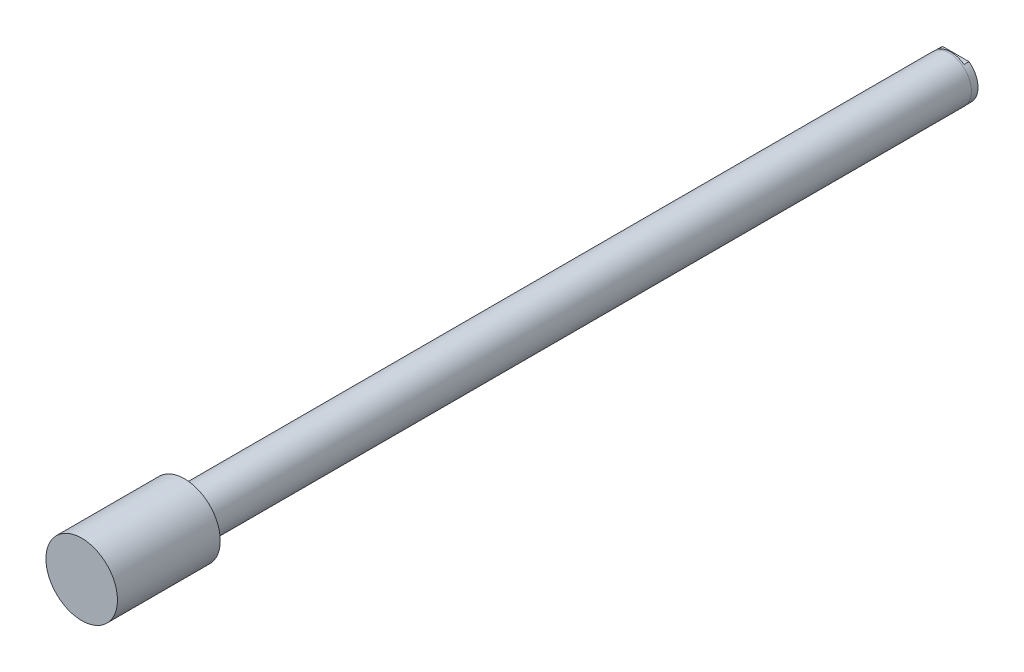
ISO-10303-21;
HEADER;
FILE_DESCRIPTION(('STEP AP214'),'2;1');
FILE_NAME('part.step','',(''),(''),'','','');
FILE_SCHEMA(('AUTOMOTIVE_DESIGN { 1 0 10303 214 1 1 1 1 }'));
ENDSEC;
DATA;
#1=APPLICATION_CONTEXT('core data for automotive mechanical design processes');
#2=APPLICATION_PROTOCOL_DEFINITION('international standard','automotive_design',2000,#1);
#3=PRODUCT_CONTEXT('',#1,'mechanical');
#4=PRODUCT('Part','Part','',(#3));
#5=PRODUCT_RELATED_PRODUCT_CATEGORY('part','',(#4));
#6=PRODUCT_DEFINITION_FORMATION('','',#4);
#7=PRODUCT_DEFINITION_CONTEXT('part definition',#1,'design');
#8=PRODUCT_DEFINITION('design','',#6,#7);
#9=PRODUCT_DEFINITION_SHAPE('','',#8);
#10=(LENGTH_UNIT() NAMED_UNIT(*) SI_UNIT(.MILLI.,.METRE.));
#11=(NAMED_UNIT(*) PLANE_ANGLE_UNIT() SI_UNIT($,.RADIAN.));
#12=(NAMED_UNIT(*) SI_UNIT($,.STERADIAN.) SOLID_ANGLE_UNIT());
#13=UNCERTAINTY_MEASURE_WITH_UNIT(LENGTH_MEASURE(1.E-05),#10,'distance_accuracy_value','');
#14=(GEOMETRIC_REPRESENTATION_CONTEXT(3) GLOBAL_UNCERTAINTY_ASSIGNED_CONTEXT((#13)) GLOBAL_UNIT_ASSIGNED_CONTEXT((#10,
#11,#12)) REPRESENTATION_CONTEXT('',''));
#15=CARTESIAN_POINT('',(0.,0.,0.));
#16=DIRECTION('',(0.,0.,1.));
#17=DIRECTION('',(1.,0.,0.));
#18=AXIS2_PLACEMENT_3D('',#15,#16,#17);
#19=CARTESIAN_POINT('',(0.,0.,27.7368));
#20=DIRECTION('',(0.,0.,-1.));
#21=DIRECTION('',(-1.,0.,0.));
#22=AXIS2_PLACEMENT_3D('',#19,#20,#21);
#23=CONICAL_SURFACE('',#22,4.96062,1.02974425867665);
#24=CARTESIAN_POINT('',(0.,0.,30.7174412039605));
#25=VERTEX_POINT('',#24);
#26=VERTEX_LOOP('',#25);
#27=FACE_BOUND('',#26,.T.);
#28=CARTESIAN_POINT('',(0.,0.,27.7368));
#29=DIRECTION('',(0.,0.,-1.));
#30=DIRECTION('',(-1.,0.,0.));
#31=AXIS2_PLACEMENT_3D('',#28,#29,#30);
#32=CIRCLE('',#31,4.96062);
#33=CARTESIAN_POINT('',(-4.96062,0.,27.7368));
#34=VERTEX_POINT('',#33);
#35=EDGE_CURVE('E93',#34,#34,#32,.T.);
#36=ORIENTED_EDGE('',*,*,#35,.T.);
#37=EDGE_LOOP('',(#36));
#38=FACE_BOUND('',#37,.T.);
#39=ADVANCED_FACE('F16',(#27,#38),#23,.F.);
#40=CARTESIAN_POINT('',(0.,0.,-4.7752));
#41=DIRECTION('',(0.,0.,-1.));
#42=DIRECTION('',(-1.,0.,0.));
#43=AXIS2_PLACEMENT_3D('',#40,#41,#42);
#44=CYLINDRICAL_SURFACE('',#43,4.96062);
#45=ORIENTED_EDGE('',*,*,#35,.F.);
#46=EDGE_LOOP('',(#45));
#47=FACE_BOUND('',#46,.T.);
#48=CARTESIAN_POINT('',(0.,0.,-4.7752));
#49=DIRECTION('',(0.,0.,-1.));
#50=DIRECTION('',(-1.,0.,0.));
#51=AXIS2_PLACEMENT_3D('',#48,#49,#50);
#52=CIRCLE('',#51,4.96062);
#53=CARTESIAN_POINT('',(-4.96062,0.,-4.7752));
#54=VERTEX_POINT('',#53);
#55=EDGE_CURVE('E97',#54,#54,#52,.T.);
#56=ORIENTED_EDGE('',*,*,#55,.T.);
#57=EDGE_LOOP('',(#56));
#58=FACE_BOUND('',#57,.T.);
#59=ADVANCED_FACE('F131',(#47,#58),#44,.F.);
#60=CARTESIAN_POINT('',(0.,0.,-1.2192));
#61=DIRECTION('',(0.,0.,-1.));
#62=DIRECTION('',(-1.,0.,0.));
#63=AXIS2_PLACEMENT_3D('',#60,#61,#62);
#64=PLANE('',#63);
#65=CARTESIAN_POINT('',(0.,0.,-1.2192));
#66=DIRECTION('',(0.,0.,-1.));
#67=DIRECTION('',(-1.,0.,0.));
#68=AXIS2_PLACEMENT_3D('',#65,#66,#67);
#69=CIRCLE('',#68,15.7607);
#70=CARTESIAN_POINT('',(9.33325583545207,-12.7,-1.2192));
#71=VERTEX_POINT('',#70);
#72=CARTESIAN_POINT('',(-9.33325583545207,-12.7,-1.2192));
#73=VERTEX_POINT('',#72);
#74=EDGE_CURVE('E65',#71,#73,#69,.T.);
#75=ORIENTED_EDGE('',*,*,#74,.T.);
#76=DIRECTION('',(1.,0.,0.));
#77=VECTOR('',#76,1.);
#78=CARTESIAN_POINT('',(9.33325583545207,-12.7,-1.2192));
#79=LINE('',#78,#77);
#80=EDGE_CURVE('E67',#73,#71,#79,.T.);
#81=ORIENTED_EDGE('',*,*,#80,.T.);
#82=EDGE_LOOP('',(#75,#81));
#83=FACE_BOUND('',#82,.T.);
#84=ADVANCED_FACE('F66',(#83),#64,.T.);
#85=CARTESIAN_POINT('',(0.,0.,-1.2192));
#86=DIRECTION('',(0.,0.,-1.));
#87=DIRECTION('',(-1.,0.,0.));
#88=AXIS2_PLACEMENT_3D('',#85,#86,#87);
#89=PLANE('',#88);
#90=CARTESIAN_POINT('',(0.,0.,-1.2192));
#91=DIRECTION('',(0.,0.,-1.));
#92=DIRECTION('',(-1.,0.,0.));
#93=AXIS2_PLACEMENT_3D('',#90,#91,#92);
#94=CIRCLE('',#93,15.7607);
#95=CARTESIAN_POINT('',(-9.33325583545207,12.7,-1.2192));
#96=VERTEX_POINT('',#95);
#97=CARTESIAN_POINT('',(9.33325583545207,12.7,-1.2192));
#98=VERTEX_POINT('',#97);
#99=EDGE_CURVE('E85',#96,#98,#94,.T.);
#100=ORIENTED_EDGE('',*,*,#99,.T.);
#101=DIRECTION('',(-1.,0.,0.));
#102=VECTOR('',#101,1.);
#103=CARTESIAN_POINT('',(9.33325583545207,12.7,-1.2192));
#104=LINE('',#103,#102);
#105=EDGE_CURVE('E87',#98,#96,#104,.T.);
#106=ORIENTED_EDGE('',*,*,#105,.T.);
#107=EDGE_LOOP('',(#100,#106));
#108=FACE_BOUND('',#107,.T.);
#109=ADVANCED_FACE('F121',(#108),#89,.T.);
#110=CARTESIAN_POINT('',(9.33325583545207,12.7,-1.2192));
#111=DIRECTION('',(0.,-1.,0.));
#112=DIRECTION('',(0.,0.,1.));
#113=AXIS2_PLACEMENT_3D('',#110,#111,#112);
#114=PLANE('',#113);
#115=DIRECTION('',(-1.,0.,0.));
#116=VECTOR('',#115,1.);
#117=CARTESIAN_POINT('',(9.33325583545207,12.7,-4.7752));
#118=LINE('',#117,#116);
#119=CARTESIAN_POINT('',(9.33325583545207,12.7,-4.7752));
#120=VERTEX_POINT('',#119);
#121=CARTESIAN_POINT('',(-9.33325583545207,12.7,-4.7752));
#122=VERTEX_POINT('',#121);
#123=EDGE_CURVE('E81',#120,#122,#118,.T.);
#124=ORIENTED_EDGE('',*,*,#123,.T.);
#125=DIRECTION('',(0.,0.,-1.));
#126=VECTOR('',#125,1.);
#127=CARTESIAN_POINT('',(-9.33325583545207,12.7,-1.2192));
#128=LINE('',#127,#126);
#129=EDGE_CURVE('E91',#96,#122,#128,.T.);
#130=ORIENTED_EDGE('',*,*,#129,.F.);
#131=ORIENTED_EDGE('',*,*,#105,.F.);
#132=DIRECTION('',(0.,0.,-1.));
#133=VECTOR('',#132,1.);
#134=CARTESIAN_POINT('',(9.33325583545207,12.7,-1.2192));
#135=LINE('',#134,#133);
#136=EDGE_CURVE('E41',#98,#120,#135,.T.);
#137=ORIENTED_EDGE('',*,*,#136,.T.);
#138=EDGE_LOOP('',(#124,#130,#131,#137));
#139=FACE_BOUND('',#138,.T.);
#140=ADVANCED_FACE('F118',(#139),#114,.F.);
#141=CARTESIAN_POINT('',(0.,0.,-4.7752));
#142=DIRECTION('',(0.,0.,-1.));
#143=DIRECTION('',(-1.,0.,0.));
#144=AXIS2_PLACEMENT_3D('',#141,#142,#143);
#145=PLANE('',#144);
#146=DIRECTION('',(1.,0.,0.));
#147=VECTOR('',#146,1.);
#148=CARTESIAN_POINT('',(9.33325583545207,-12.7,-4.7752));
#149=LINE('',#148,#147);
#150=CARTESIAN_POINT('',(-9.33325583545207,-12.7,-4.7752));
#151=VERTEX_POINT('',#150);
#152=CARTESIAN_POINT('',(9.33325583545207,-12.7,-4.7752));
#153=VERTEX_POINT('',#152);
#154=EDGE_CURVE('E70',#151,#153,#149,.T.);
#155=ORIENTED_EDGE('',*,*,#154,.F.);
#156=CARTESIAN_POINT('',(0.,0.,-4.7752));
#157=DIRECTION('',(0.,0.,-1.));
#158=DIRECTION('',(-1.,0.,0.));
#159=AXIS2_PLACEMENT_3D('',#156,#157,#158);
#160=CIRCLE('',#159,15.7607);
#161=EDGE_CURVE('E79',#151,#122,#160,.T.);
#162=ORIENTED_EDGE('',*,*,#161,.T.);
#163=ORIENTED_EDGE('',*,*,#123,.F.);
#164=EDGE_CURVE('E25',#120,#153,#160,.T.);
#165=ORIENTED_EDGE('',*,*,#164,.T.);
#166=EDGE_LOOP('',(#155,#162,#163,#165));
#167=FACE_BOUND('',#166,.T.);
#168=ORIENTED_EDGE('',*,*,#55,.F.);
#169=EDGE_LOOP('',(#168));
#170=FACE_BOUND('',#169,.T.);
#171=ADVANCED_FACE('F116',(#167,#170),#145,.T.);
#172=CARTESIAN_POINT('',(9.33325583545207,-12.7,-1.2192));
#173=DIRECTION('',(0.,1.,0.));
#174=DIRECTION('',(0.,0.,-1.));
#175=AXIS2_PLACEMENT_3D('',#172,#173,#174);
#176=PLANE('',#175);
#177=ORIENTED_EDGE('',*,*,#154,.T.);
#178=DIRECTION('',(0.,0.,-1.));
#179=VECTOR('',#178,1.);
#180=CARTESIAN_POINT('',(9.33325583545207,-12.7,-1.2192));
#181=LINE('',#180,#179);
#182=EDGE_CURVE('E73',#71,#153,#181,.T.);
#183=ORIENTED_EDGE('',*,*,#182,.F.);
#184=ORIENTED_EDGE('',*,*,#80,.F.);
#185=DIRECTION('',(0.,0.,-1.));
#186=VECTOR('',#185,1.);
#187=CARTESIAN_POINT('',(-9.33325583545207,-12.7,-1.2192));
#188=LINE('',#187,#186);
#189=EDGE_CURVE('E33',#73,#151,#188,.T.);
#190=ORIENTED_EDGE('',*,*,#189,.T.);
#191=EDGE_LOOP('',(#177,#183,#184,#190));
#192=FACE_BOUND('',#191,.T.);
#193=ADVANCED_FACE('F72',(#192),#176,.F.);
#194=CARTESIAN_POINT('',(0.,0.,0.));
#195=DIRECTION('',(0.,0.,-1.));
#196=DIRECTION('',(-1.,0.,0.));
#197=AXIS2_PLACEMENT_3D('',#194,#195,#196);
#198=CYLINDRICAL_SURFACE('',#197,15.7607);
#199=ORIENTED_EDGE('',*,*,#182,.T.);
#200=ORIENTED_EDGE('',*,*,#164,.F.);
#201=ORIENTED_EDGE('',*,*,#136,.F.);
#202=ORIENTED_EDGE('',*,*,#99,.F.);
#203=ORIENTED_EDGE('',*,*,#129,.T.);
#204=ORIENTED_EDGE('',*,*,#161,.F.);
#205=ORIENTED_EDGE('',*,*,#189,.F.);
#206=ORIENTED_EDGE('',*,*,#74,.F.);
#207=EDGE_LOOP('',(#199,#200,#201,#202,#203,#204,#205,#206));
#208=FACE_BOUND('',#207,.T.);
#209=CARTESIAN_POINT('',(0.,0.,0.));
#210=DIRECTION('',(0.,0.,-1.));
#211=DIRECTION('',(-1.,0.,0.));
#212=AXIS2_PLACEMENT_3D('',#209,#210,#211);
#213=CIRCLE('',#212,15.7607);
#214=CARTESIAN_POINT('',(-15.7607,0.,0.));
#215=VERTEX_POINT('',#214);
#216=EDGE_CURVE('E10',#215,#215,#213,.T.);
#217=ORIENTED_EDGE('',*,*,#216,.T.);
#218=EDGE_LOOP('',(#217));
#219=FACE_BOUND('',#218,.T.);
#220=ADVANCED_FACE('F76',(#208,#219),#198,.T.);
#221=CARTESIAN_POINT('',(0.,0.,616.1024));
#222=DIRECTION('',(0.,0.,1.));
#223=DIRECTION('',(1.,0.,0.));
#224=AXIS2_PLACEMENT_3D('',#221,#222,#223);
#225=PLANE('',#224);
#226=CARTESIAN_POINT('',(0.,0.,616.1024));
#227=DIRECTION('',(0.,0.,1.));
#228=DIRECTION('',(1.,0.,0.));
#229=AXIS2_PLACEMENT_3D('',#226,#227,#228);
#230=CIRCLE('',#229,25.4);
#231=CARTESIAN_POINT('',(25.4,0.,616.1024));
#232=VERTEX_POINT('',#231);
#233=EDGE_CURVE('E102',#232,#232,#230,.T.);
#234=ORIENTED_EDGE('',*,*,#233,.T.);
#235=EDGE_LOOP('',(#234));
#236=FACE_BOUND('',#235,.T.);
#237=ADVANCED_FACE('F149',(#236),#225,.T.);
#238=CARTESIAN_POINT('',(0.,0.,616.1024));
#239=DIRECTION('',(0.,0.,-1.));
#240=DIRECTION('',(-1.,0.,0.));
#241=AXIS2_PLACEMENT_3D('',#238,#239,#240);
#242=CYLINDRICAL_SURFACE('',#241,25.4);
#243=ORIENTED_EDGE('',*,*,#233,.F.);
#244=EDGE_LOOP('',(#243));
#245=FACE_BOUND('',#244,.T.);
#246=CARTESIAN_POINT('',(0.,0.,543.0774));
#247=DIRECTION('',(0.,0.,1.));
#248=DIRECTION('',(1.,0.,0.));
#249=AXIS2_PLACEMENT_3D('',#246,#247,#248);
#250=CIRCLE('',#249,25.4);
#251=CARTESIAN_POINT('',(25.4,0.,543.0774));
#252=VERTEX_POINT('',#251);
#253=EDGE_CURVE('E106',#252,#252,#250,.T.);
#254=ORIENTED_EDGE('',*,*,#253,.T.);
#255=EDGE_LOOP('',(#254));
#256=FACE_BOUND('',#255,.T.);
#257=ADVANCED_FACE('F152',(#245,#256),#242,.T.);
#258=CARTESIAN_POINT('',(0.,0.,543.0774));
#259=DIRECTION('',(0.,0.,1.));
#260=DIRECTION('',(1.,0.,0.));
#261=AXIS2_PLACEMENT_3D('',#258,#259,#260);
#262=PLANE('',#261);
#263=CARTESIAN_POINT('',(0.,0.,543.0774));
#264=DIRECTION('',(0.,0.,1.));
#265=DIRECTION('',(1.,0.,0.));
#266=AXIS2_PLACEMENT_3D('',#263,#264,#265);
#267=CIRCLE('',#266,15.875);
#268=CARTESIAN_POINT('',(15.875,0.,543.0774));
#269=VERTEX_POINT('',#268);
#270=EDGE_CURVE('E105',#269,#269,#267,.F.);
#271=ORIENTED_EDGE('',*,*,#270,.F.);
#272=EDGE_LOOP('',(#271));
#273=FACE_BOUND('',#272,.T.);
#274=ORIENTED_EDGE('',*,*,#253,.F.);
#275=EDGE_LOOP('',(#274));
#276=FACE_BOUND('',#275,.T.);
#277=ADVANCED_FACE('F154',(#273,#276),#262,.F.);
#278=CARTESIAN_POINT('',(0.,0.,543.0774));
#279=DIRECTION('',(0.,0.,-1.));
#280=DIRECTION('',(-1.,0.,0.));
#281=AXIS2_PLACEMENT_3D('',#278,#279,#280);
#282=CYLINDRICAL_SURFACE('',#281,15.875);
#283=CARTESIAN_POINT('',(0.,0.,0.));
#284=DIRECTION('',(0.,0.,-1.));
#285=DIRECTION('',(-1.,0.,0.));
#286=AXIS2_PLACEMENT_3D('',#283,#284,#285);
#287=CIRCLE('',#286,15.875);
#288=CARTESIAN_POINT('',(-15.875,0.,0.));
#289=VERTEX_POINT('',#288);
#290=EDGE_CURVE('E20',#289,#289,#287,.T.);
#291=ORIENTED_EDGE('',*,*,#290,.F.);
#292=EDGE_LOOP('',(#291));
#293=FACE_BOUND('',#292,.T.);
#294=ORIENTED_EDGE('',*,*,#270,.T.);
#295=EDGE_LOOP('',(#294));
#296=FACE_BOUND('',#295,.T.);
#297=ADVANCED_FACE('F18',(#293,#296),#282,.T.);
#298=CARTESIAN_POINT('',(0.,0.,0.));
#299=DIRECTION('',(0.,0.,-1.));
#300=DIRECTION('',(-1.,0.,0.));
#301=AXIS2_PLACEMENT_3D('',#298,#299,#300);
#302=PLANE('',#301);
#303=ORIENTED_EDGE('',*,*,#290,.T.);
#304=EDGE_LOOP('',(#303));
#305=FACE_BOUND('',#304,.T.);
#306=ORIENTED_EDGE('',*,*,#216,.F.);
#307=EDGE_LOOP('',(#306));
#308=FACE_BOUND('',#307,.T.);
#309=ADVANCED_FACE('F158',(#305,#308),#302,.T.);
#310=CLOSED_SHELL('',(#39,#59,#84,#109,#140,#171,#193,#220,#237,#257,#277,#297,#309));
#311=MANIFOLD_SOLID_BREP('B1',#310);
#312=ADVANCED_BREP_SHAPE_REPRESENTATION('',(#18,#311),#14);
#313=SHAPE_DEFINITION_REPRESENTATION(#9,#312);
ENDSEC;
END-ISO-10303-21;
